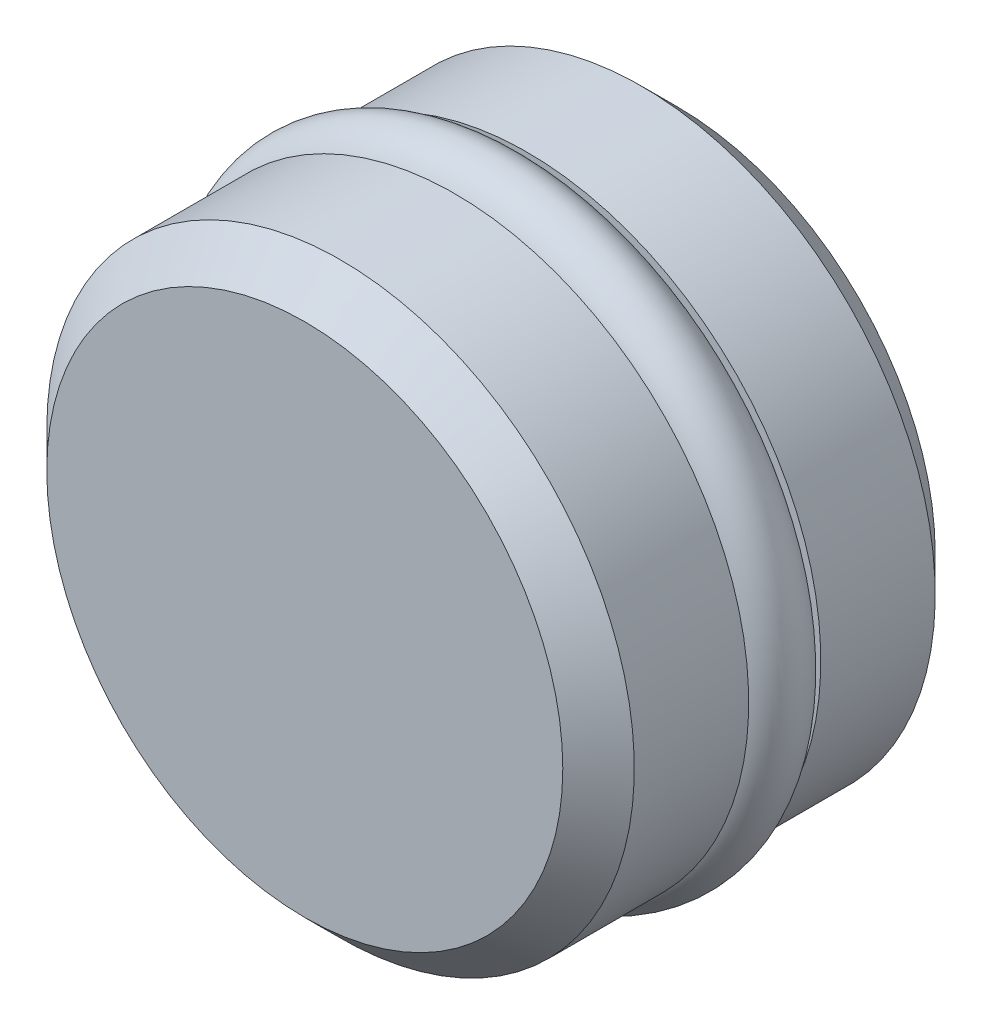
ISO-10303-21;
HEADER;
FILE_DESCRIPTION(('STEP AP214'),'2;1');
FILE_NAME('part.step','',(''),(''),'','','');
FILE_SCHEMA(('AUTOMOTIVE_DESIGN { 1 0 10303 214 1 1 1 1 }'));
ENDSEC;
DATA;
#1=APPLICATION_CONTEXT('core data for automotive mechanical design processes');
#2=APPLICATION_PROTOCOL_DEFINITION('international standard','automotive_design',2000,#1);
#3=PRODUCT_CONTEXT('',#1,'mechanical');
#4=PRODUCT('Part','Part','',(#3));
#5=PRODUCT_RELATED_PRODUCT_CATEGORY('part','',(#4));
#6=PRODUCT_DEFINITION_FORMATION('','',#4);
#7=PRODUCT_DEFINITION_CONTEXT('part definition',#1,'design');
#8=PRODUCT_DEFINITION('design','',#6,#7);
#9=PRODUCT_DEFINITION_SHAPE('','',#8);
#10=(LENGTH_UNIT() NAMED_UNIT(*) SI_UNIT(.MILLI.,.METRE.));
#11=(NAMED_UNIT(*) PLANE_ANGLE_UNIT() SI_UNIT($,.RADIAN.));
#12=(NAMED_UNIT(*) SI_UNIT($,.STERADIAN.) SOLID_ANGLE_UNIT());
#13=UNCERTAINTY_MEASURE_WITH_UNIT(LENGTH_MEASURE(1.E-05),#10,'distance_accuracy_value','');
#14=(GEOMETRIC_REPRESENTATION_CONTEXT(3) GLOBAL_UNCERTAINTY_ASSIGNED_CONTEXT((#13)) GLOBAL_UNIT_ASSIGNED_CONTEXT((#10,
#11,#12)) REPRESENTATION_CONTEXT('',''));
#15=CARTESIAN_POINT('',(0.,0.,0.));
#16=DIRECTION('',(0.,0.,1.));
#17=DIRECTION('',(1.,0.,0.));
#18=AXIS2_PLACEMENT_3D('',#15,#16,#17);
#19=CARTESIAN_POINT('',(0.,0.,3.96875));
#20=DIRECTION('',(0.,0.,-1.));
#21=DIRECTION('',(-1.,0.,0.));
#22=AXIS2_PLACEMENT_3D('',#19,#20,#21);
#23=TOROIDAL_SURFACE('',#22,5.83565,0.76835);
#24=CARTESIAN_POINT('',(-6.604,0.,3.96875));
#25=VERTEX_POINT('',#24);
#26=VERTEX_LOOP('',#25);
#27=FACE_BOUND('',#26,.T.);
#28=ADVANCED_FACE('P0_F12',(#27),#23,.T.);
#29=CLOSED_SHELL('',(#28));
#30=MANIFOLD_SOLID_BREP('P0_B1',#29);
#31=CARTESIAN_POINT('',(0.,0.,6.35000000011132));
#32=DIRECTION('',(0.,0.,-1.));
#33=DIRECTION('',(-1.,0.,0.));
#34=AXIS2_PLACEMENT_3D('',#31,#32,#33);
#35=CONICAL_SURFACE('',#34,1.98373999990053,1.02974425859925);
#36=CARTESIAN_POINT('',(0.,1.13686837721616E-10,7.54195124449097));
#37=VERTEX_POINT('',#36);
#38=VERTEX_LOOP('',#37);
#39=FACE_BOUND('',#38,.T.);
#40=CARTESIAN_POINT('',(0.,0.,6.35));
#41=DIRECTION('',(0.,0.,1.));
#42=DIRECTION('',(1.,0.,0.));
#43=AXIS2_PLACEMENT_3D('',#40,#41,#42);
#44=CIRCLE('',#43,1.98374);
#45=CARTESIAN_POINT('',(1.98374,0.,6.35));
#46=VERTEX_POINT('',#45);
#47=EDGE_CURVE('P1_E33',#46,#46,#44,.F.);
#48=ORIENTED_EDGE('',*,*,#47,.T.);
#49=EDGE_LOOP('',(#48));
#50=FACE_BOUND('',#49,.T.);
#51=ADVANCED_FACE('P1_F16',(#39,#50),#35,.F.);
#52=CARTESIAN_POINT('',(0.,0.,0.));
#53=DIRECTION('',(0.,0.,1.));
#54=DIRECTION('',(1.,0.,0.));
#55=AXIS2_PLACEMENT_3D('',#52,#53,#54);
#56=CYLINDRICAL_SURFACE('',#55,1.98374);
#57=ORIENTED_EDGE('',*,*,#47,.F.);
#58=EDGE_LOOP('',(#57));
#59=FACE_BOUND('',#58,.T.);
#60=CARTESIAN_POINT('',(0.,0.,0.));
#61=DIRECTION('',(0.,0.,1.));
#62=DIRECTION('',(1.,0.,0.));
#63=AXIS2_PLACEMENT_3D('',#60,#61,#62);
#64=CIRCLE('',#63,1.98374);
#65=CARTESIAN_POINT('',(1.98374,0.,0.));
#66=VERTEX_POINT('',#65);
#67=EDGE_CURVE('P1_E35',#66,#66,#64,.T.);
#68=ORIENTED_EDGE('',*,*,#67,.F.);
#69=EDGE_LOOP('',(#68));
#70=FACE_BOUND('',#69,.T.);
#71=ADVANCED_FACE('P1_F29',(#59,#70),#56,.F.);
#72=CARTESIAN_POINT('',(0.,0.,0.));
#73=DIRECTION('',(0.,0.,-1.));
#74=DIRECTION('',(-1.,0.,0.));
#75=AXIS2_PLACEMENT_3D('',#72,#73,#74);
#76=PLANE('',#75);
#77=CARTESIAN_POINT('',(0.,0.,0.));
#78=DIRECTION('',(0.,0.,1.));
#79=DIRECTION('',(0.,-1.,0.));
#80=AXIS2_PLACEMENT_3D('',#77,#78,#79);
#81=CIRCLE('',#80,5.49910000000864);
#82=CARTESIAN_POINT('',(0.,-5.49910000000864,0.));
#83=VERTEX_POINT('',#82);
#84=EDGE_CURVE('P1_E39',#83,#83,#81,.T.);
#85=ORIENTED_EDGE('',*,*,#84,.F.);
#86=EDGE_LOOP('',(#85));
#87=FACE_BOUND('',#86,.T.);
#88=ORIENTED_EDGE('',*,*,#67,.T.);
#89=EDGE_LOOP('',(#88));
#90=FACE_BOUND('',#89,.T.);
#91=ADVANCED_FACE('P1_F63',(#87,#90),#76,.T.);
#92=CARTESIAN_POINT('',(0.,0.,0.762000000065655));
#93=DIRECTION('',(0.,0.,1.));
#94=DIRECTION('',(0.,-1.,0.));
#95=AXIS2_PLACEMENT_3D('',#92,#93,#94);
#96=CONICAL_SURFACE('',#95,6.26110000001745,0.785398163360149);
#97=CARTESIAN_POINT('',(0.,0.,0.762));
#98=DIRECTION('',(0.,0.,-1.));
#99=DIRECTION('',(-1.,0.,0.));
#100=AXIS2_PLACEMENT_3D('',#97,#98,#99);
#101=CIRCLE('',#100,6.2611);
#102=CARTESIAN_POINT('',(-6.2611,0.,0.762));
#103=VERTEX_POINT('',#102);
#104=EDGE_CURVE('P1_E43',#103,#103,#101,.F.);
#105=ORIENTED_EDGE('',*,*,#104,.F.);
#106=EDGE_LOOP('',(#105));
#107=FACE_BOUND('',#106,.T.);
#108=ORIENTED_EDGE('',*,*,#84,.T.);
#109=EDGE_LOOP('',(#108));
#110=FACE_BOUND('',#109,.T.);
#111=ADVANCED_FACE('P1_F61',(#107,#110),#96,.T.);
#112=CARTESIAN_POINT('',(0.,0.,7.9375));
#113=DIRECTION('',(0.,0.,-1.));
#114=DIRECTION('',(-1.,0.,0.));
#115=AXIS2_PLACEMENT_3D('',#112,#113,#114);
#116=CYLINDRICAL_SURFACE('',#115,6.2611);
#117=ORIENTED_EDGE('',*,*,#104,.T.);
#118=EDGE_LOOP('',(#117));
#119=FACE_BOUND('',#118,.T.);
#120=CARTESIAN_POINT('',(0.,0.,3.2004));
#121=DIRECTION('',(0.,0.,-1.));
#122=DIRECTION('',(-1.,0.,0.));
#123=AXIS2_PLACEMENT_3D('',#120,#121,#122);
#124=CIRCLE('',#123,6.2611);
#125=CARTESIAN_POINT('',(-6.2611,0.,3.2004));
#126=VERTEX_POINT('',#125);
#127=EDGE_CURVE('P1_E49',#126,#126,#124,.F.);
#128=ORIENTED_EDGE('',*,*,#127,.F.);
#129=EDGE_LOOP('',(#128));
#130=FACE_BOUND('',#129,.T.);
#131=ADVANCED_FACE('P1_F58',(#119,#130),#116,.T.);
#132=CARTESIAN_POINT('',(-5.0546,0.,3.2004));
#133=DIRECTION('',(0.,0.,1.));
#134=DIRECTION('',(1.,0.,0.));
#135=AXIS2_PLACEMENT_3D('',#132,#133,#134);
#136=PLANE('',#135);
#137=ORIENTED_EDGE('',*,*,#127,.T.);
#138=EDGE_LOOP('',(#137));
#139=FACE_BOUND('',#138,.T.);
#140=CARTESIAN_POINT('',(0.,0.,3.2004));
#141=DIRECTION('',(0.,0.,-1.));
#142=DIRECTION('',(-1.,0.,0.));
#143=AXIS2_PLACEMENT_3D('',#140,#141,#142);
#144=CIRCLE('',#143,5.0673);
#145=CARTESIAN_POINT('',(-5.0673,0.,3.2004));
#146=VERTEX_POINT('',#145);
#147=EDGE_CURVE('P1_E36',#146,#146,#144,.T.);
#148=ORIENTED_EDGE('',*,*,#147,.T.);
#149=EDGE_LOOP('',(#148));
#150=FACE_BOUND('',#149,.T.);
#151=ADVANCED_FACE('P1_F70',(#139,#150),#136,.T.);
#152=CARTESIAN_POINT('',(0.,0.,0.));
#153=DIRECTION('',(0.,0.,-1.));
#154=DIRECTION('',(-1.,0.,0.));
#155=AXIS2_PLACEMENT_3D('',#152,#153,#154);
#156=CYLINDRICAL_SURFACE('',#155,5.0673);
#157=ORIENTED_EDGE('',*,*,#147,.F.);
#158=EDGE_LOOP('',(#157));
#159=FACE_BOUND('',#158,.T.);
#160=CARTESIAN_POINT('',(0.,0.,4.7371));
#161=DIRECTION('',(0.,0.,-1.));
#162=DIRECTION('',(-1.,0.,0.));
#163=AXIS2_PLACEMENT_3D('',#160,#161,#162);
#164=CIRCLE('',#163,5.0673);
#165=CARTESIAN_POINT('',(-5.0673,0.,4.7371));
#166=VERTEX_POINT('',#165);
#167=EDGE_CURVE('P1_E19',#166,#166,#164,.F.);
#168=ORIENTED_EDGE('',*,*,#167,.F.);
#169=EDGE_LOOP('',(#168));
#170=FACE_BOUND('',#169,.T.);
#171=ADVANCED_FACE('P1_F30',(#159,#170),#156,.T.);
#172=CARTESIAN_POINT('',(0.,0.,7.9375));
#173=DIRECTION('',(0.,0.,-1.));
#174=DIRECTION('',(-1.,0.,0.));
#175=AXIS2_PLACEMENT_3D('',#172,#173,#174);
#176=PLANE('',#175);
#177=CARTESIAN_POINT('',(0.,0.,7.93749999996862));
#178=DIRECTION('',(0.,0.,-1.));
#179=DIRECTION('',(-1.,0.,0.));
#180=AXIS2_PLACEMENT_3D('',#177,#178,#179);
#181=CIRCLE('',#180,5.4990999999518);
#182=CARTESIAN_POINT('',(-5.4990999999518,0.,7.93749999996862));
#183=VERTEX_POINT('',#182);
#184=EDGE_CURVE('P1_E10',#183,#183,#181,.T.);
#185=ORIENTED_EDGE('',*,*,#184,.F.);
#186=EDGE_LOOP('',(#185));
#187=FACE_BOUND('',#186,.T.);
#188=ADVANCED_FACE('P1_F80',(#187),#176,.F.);
#189=CARTESIAN_POINT('',(0.,0.,7.17550000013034));
#190=DIRECTION('',(0.,0.,-1.));
#191=DIRECTION('',(-1.,0.,0.));
#192=AXIS2_PLACEMENT_3D('',#189,#190,#191);
#193=CONICAL_SURFACE('',#192,6.26109999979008,0.785398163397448);
#194=ORIENTED_EDGE('',*,*,#184,.T.);
#195=EDGE_LOOP('',(#194));
#196=FACE_BOUND('',#195,.T.);
#197=CARTESIAN_POINT('',(0.,0.,7.17550000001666));
#198=DIRECTION('',(0.,0.,-1.));
#199=DIRECTION('',(-1.,0.,0.));
#200=AXIS2_PLACEMENT_3D('',#197,#198,#199);
#201=CIRCLE('',#200,6.26109999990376);
#202=CARTESIAN_POINT('',(-6.26109999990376,0.,7.17550000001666));
#203=VERTEX_POINT('',#202);
#204=EDGE_CURVE('P1_E23',#203,#203,#201,.F.);
#205=ORIENTED_EDGE('',*,*,#204,.T.);
#206=EDGE_LOOP('',(#205));
#207=FACE_BOUND('',#206,.T.);
#208=ADVANCED_FACE('P1_F92',(#196,#207),#193,.T.);
#209=CARTESIAN_POINT('',(0.,0.,7.9375));
#210=DIRECTION('',(0.,0.,-1.));
#211=DIRECTION('',(-1.,0.,0.));
#212=AXIS2_PLACEMENT_3D('',#209,#210,#211);
#213=CYLINDRICAL_SURFACE('',#212,6.2611);
#214=ORIENTED_EDGE('',*,*,#204,.F.);
#215=EDGE_LOOP('',(#214));
#216=FACE_BOUND('',#215,.T.);
#217=CARTESIAN_POINT('',(0.,0.,4.7371));
#218=DIRECTION('',(0.,0.,-1.));
#219=DIRECTION('',(-1.,0.,0.));
#220=AXIS2_PLACEMENT_3D('',#217,#218,#219);
#221=CIRCLE('',#220,6.2611);
#222=CARTESIAN_POINT('',(-6.2611,0.,4.7371));
#223=VERTEX_POINT('',#222);
#224=EDGE_CURVE('P1_E46',#223,#223,#221,.F.);
#225=ORIENTED_EDGE('',*,*,#224,.T.);
#226=EDGE_LOOP('',(#225));
#227=FACE_BOUND('',#226,.T.);
#228=ADVANCED_FACE('P1_F88',(#216,#227),#213,.T.);
#229=CARTESIAN_POINT('',(-6.2611,0.,4.7371));
#230=DIRECTION('',(0.,0.,-1.));
#231=DIRECTION('',(-1.,0.,0.));
#232=AXIS2_PLACEMENT_3D('',#229,#230,#231);
#233=PLANE('',#232);
#234=ORIENTED_EDGE('',*,*,#224,.F.);
#235=EDGE_LOOP('',(#234));
#236=FACE_BOUND('',#235,.T.);
#237=ORIENTED_EDGE('',*,*,#167,.T.);
#238=EDGE_LOOP('',(#237));
#239=FACE_BOUND('',#238,.T.);
#240=ADVANCED_FACE('P1_F85',(#236,#239),#233,.T.);
#241=CLOSED_SHELL('',(#51,#71,#91,#111,#131,#151,#171,#188,#208,#228,#240));
#242=MANIFOLD_SOLID_BREP('P1_B1',#241);
#243=ADVANCED_BREP_SHAPE_REPRESENTATION('',(#18,#30,#242),#14);
#244=SHAPE_DEFINITION_REPRESENTATION(#9,#243);
ENDSEC;
END-ISO-10303-21;
